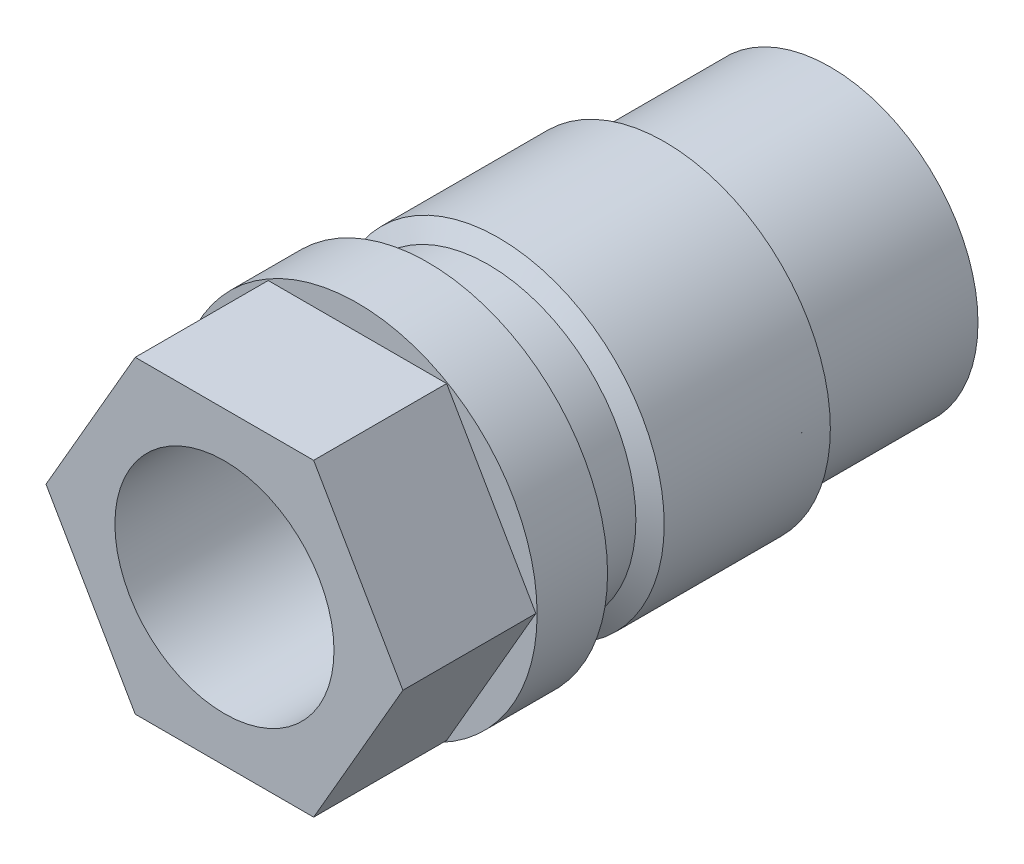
from build123d import *

# Parameters (mm, degrees)
ESQUISSE1_R             = 12.5
ESQUISSE1_R_2           = 7.62
BASE_EXTRUSION_DEPTH    = 14.15
BOSS_EXTRU_1_START      = 28
ESQUISSE2_R             = 10.27
ESQUISSE2_R_2           = 7.62
BOSS_EXTRU_1_DEPTH      = 28
ENL_V_START             = -9.25
ESQUISSE4_R             = 12.5
ENL_V_MAT_EXTRU_1_DEPTH = 9.25


with BuildPart() as part:
    # Esquisse1 → Base-Extrusion (new body)
    with BuildSketch(Plane.XY):
        Circle(ESQUISSE1_R)
        with Locations(Location((0, 0, 0), (0, 0, 180))):
            Circle(ESQUISSE1_R_2, mode=Mode.SUBTRACT)
    extrude(amount=BASE_EXTRUSION_DEPTH)

    # Esquisse2 → Boss.-Extru.1 (add)
    with BuildSketch(Plane(origin=(0, 0, 0), x_dir=(-1, 0, 0), z_dir=(0, 0, -1)).offset(BOSS_EXTRU_1_START)):
        with Locations(Location((0, 0, 0), (0, 0, 180))):
            Circle(ESQUISSE2_R)
        Circle(ESQUISSE2_R_2, mode=Mode.SUBTRACT)
    extrude(amount=-BOSS_EXTRU_1_DEPTH)

    # Esquisse3 → Boss.-R_vol.1 (revolve)
    with BuildSketch(Plane.ZY, mode=Mode.PRIVATE) as boss_r_vol_1_sk:
        Polygon((-17.2, 10.27), (-4.2, 10.27), (-4.921687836, 11.52), (-16.478312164, 11.52), align=None)
    revolve(boss_r_vol_1_sk.sketch.rotate(Axis((0, 0, -46), (0, 0, 1)), 270), axis=Axis((0, 0, -46), (0, 0, 1)))

    # Esquisse4 → Enl_v. mat.-Extru.1 (cut)
    with BuildSketch(Plane.XY.offset(14.15).offset(ENL_V_START)):
        Circle(ESQUISSE4_R)
        Polygon((6.206515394, 10.75), (-6.206515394, 10.75), (-12.413030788, 0), (-6.206515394, -10.75), (6.206515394, -10.75), (12.413030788, 0), align=None, mode=Mode.SUBTRACT)
    extrude(amount=ENL_V_MAT_EXTRU_1_DEPTH, mode=Mode.SUBTRACT)


solid = part.part
